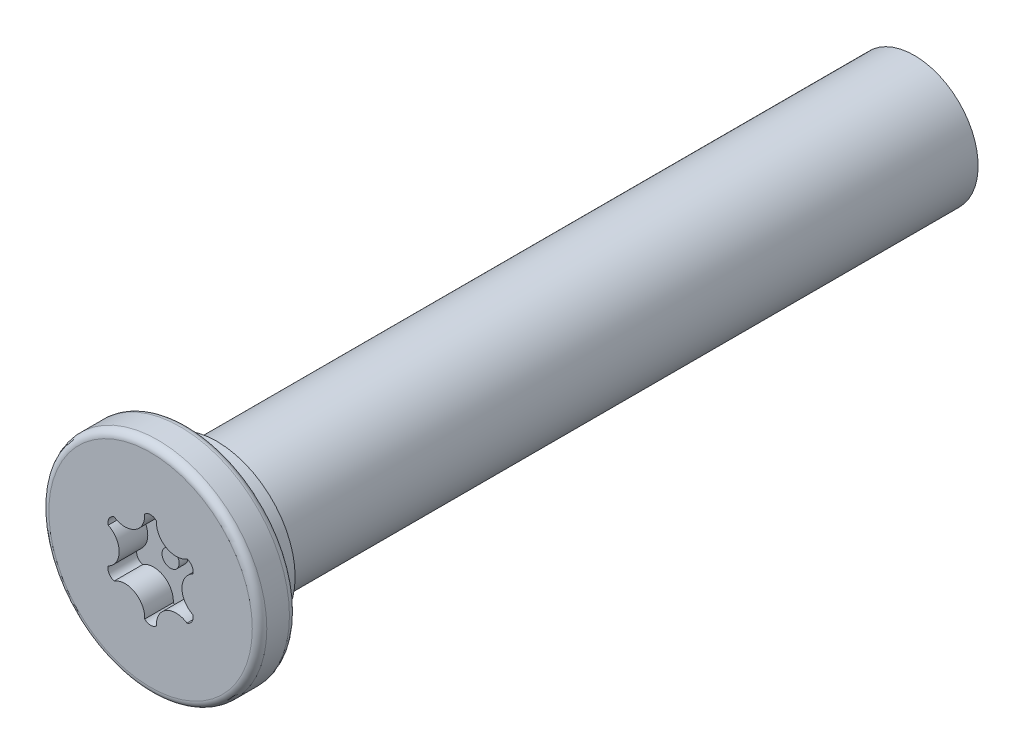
from build123d import *

# Parameters (mm, degrees)
SKETCH2_W           = 1.3
SKETCH2_H           = 3.81
SKETCH2_W_2         = 12.7
SKETCH2_H_2         = 2.23
CUT_EXTRUDE3_DEPTH  = 1
FILLET12_R          = 0.254
CUT_EXTRUDE6_START  = -12.7
SKETCH7_R           = 2.23
CUT_EXTRUDE6_DEPTH  = 12.7
SKETCH11_R          = 2.738000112
SKETCH11_R_2        = 2.230000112
BOSS_EXTRUDE1_DEPTH = 1.016
SKETCH12_R          = 2.230000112
BOSS_EXTRUDE2_DEPTH = 12.7
SKETCH14_R          = 0.3
BOSS_EXTRUDE4_DEPTH = 0.3
CUT_EXTRUDE7_START  = -12.7
SKETCH15_R          = 2.230000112
CUT_EXTRUDE7_DEPTH  = 12.7
SKETCH16_R          = 2.230000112
BOSS_EXTRUDE5_DEPTH = 25.4


with BuildPart() as part:
    # Sketch2 → Revolve1 (revolve)
    with BuildSketch(Plane(origin=(0, 0, 0), x_dir=(0, 0, -1), z_dir=(1, 0, 0)), mode=Mode.PRIVATE) as revolve1_sk:
        with Locations((0.65, 1.905)):
            Rectangle(SKETCH2_W, SKETCH2_H)
        with Locations((7.65, 1.115)):
            Rectangle(SKETCH2_W_2, SKETCH2_H_2)
    revolve(revolve1_sk.sketch.rotate(Axis((0, 0, -1.3), (0, 0, -1)), 90), axis=Axis((0, 0, -1.3), (0, 0, -1)))

    # Sketch3 → Cut-Extrude3 (cut)
    with BuildSketch(Plane.XY):
        with BuildLine():
            ThreePointArc((-0.205060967, 1.589373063), (0, 1.674312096), (0.205060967, 1.589373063))
            ThreePointArc((0.205060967, 1.589373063), (0.54882888, 0.950599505), (1.273906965, 0.972274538))
            ThreePointArc((1.273906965, 0.972274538), (1.449996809, 0.837156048), (1.478967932, 0.617098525))
            ThreePointArc((1.478967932, 0.617098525), (1.097657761, 0), (1.478967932, -0.617098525))
            ThreePointArc((1.478967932, -0.617098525), (1.449996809, -0.837156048), (1.273906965, -0.972274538))
            ThreePointArc((1.273906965, -0.972274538), (0.54882888, -0.950599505), (0.205060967, -1.589373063))
            ThreePointArc((0.205060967, -1.589373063), (0, -1.674312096), (-0.205060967, -1.589373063))
            ThreePointArc((-0.205060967, -1.589373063), (-0.54882888, -0.950599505), (-1.273906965, -0.972274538))
            ThreePointArc((-1.273906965, -0.972274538), (-1.449996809, -0.837156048), (-1.478967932, -0.617098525))
            ThreePointArc((-1.478967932, -0.617098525), (-1.097657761, 0), (-1.478967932, 0.617098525))
            ThreePointArc((-1.478967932, 0.617098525), (-1.449996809, 0.837156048), (-1.273906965, 0.972274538))
            ThreePointArc((-1.273906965, 0.972274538), (-0.54882888, 0.950599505), (-0.205060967, 1.589373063))
        make_face()
    extrude(amount=-CUT_EXTRUDE3_DEPTH, mode=Mode.SUBTRACT)

    # Fillet12
    fillet12_edges = [part.edges().sort_by_distance(p)[0] for p in [
        (-3.81, 0, 0),
        (-3.81, 0, -1.3),
    ]]
    fillet(fillet12_edges, radius=FILLET12_R)

    # Sketch7 → Cut-Extrude6 (cut)
    with BuildSketch(Plane(origin=(0, 0, -14), x_dir=(-1, 0, 0), z_dir=(0, 0, -1)).offset(CUT_EXTRUDE6_START)):
        Circle(SKETCH7_R)
    extrude(amount=CUT_EXTRUDE6_DEPTH, mode=Mode.SUBTRACT)

    # Sketch11 → Boss-Extrude1 (add)
    with BuildSketch(Plane(origin=(0, 0, -1.3), x_dir=(-1, 0, 0), z_dir=(0, 0, -1))):
        with Locations(Location((0, 0, 0), (0, 0, 180))):
            Circle(SKETCH11_R)
        Circle(SKETCH11_R_2, mode=Mode.SUBTRACT)
    extrude(amount=BOSS_EXTRUDE1_DEPTH)

    # Sketch12 → Boss-Extrude2 (add)
    with BuildSketch(Plane(origin=(0, 0, -1.3), x_dir=(-1, 0, 0), z_dir=(0, 0, -1))):
        Circle(SKETCH12_R)
    extrude(amount=BOSS_EXTRUDE2_DEPTH)

    # Sketch14 → Boss-Extrude4 (add)
    with BuildSketch(Plane.XY.offset(-1)):
        Circle(SKETCH14_R)
    extrude(amount=BOSS_EXTRUDE4_DEPTH)

    # Sketch15 → Cut-Extrude7 (cut)
    with BuildSketch(Plane(origin=(0, 0, -14), x_dir=(-1, 0, 0), z_dir=(0, 0, -1)).offset(CUT_EXTRUDE7_START)):
        Circle(SKETCH15_R)
    extrude(amount=CUT_EXTRUDE7_DEPTH, mode=Mode.SUBTRACT)

    # Sketch16 → Boss-Extrude5 (add)
    with BuildSketch(Plane(origin=(0, 0, -1.3), x_dir=(-1, 0, 0), z_dir=(0, 0, -1))):
        Circle(SKETCH16_R)
    extrude(amount=BOSS_EXTRUDE5_DEPTH)


solid = part.part
